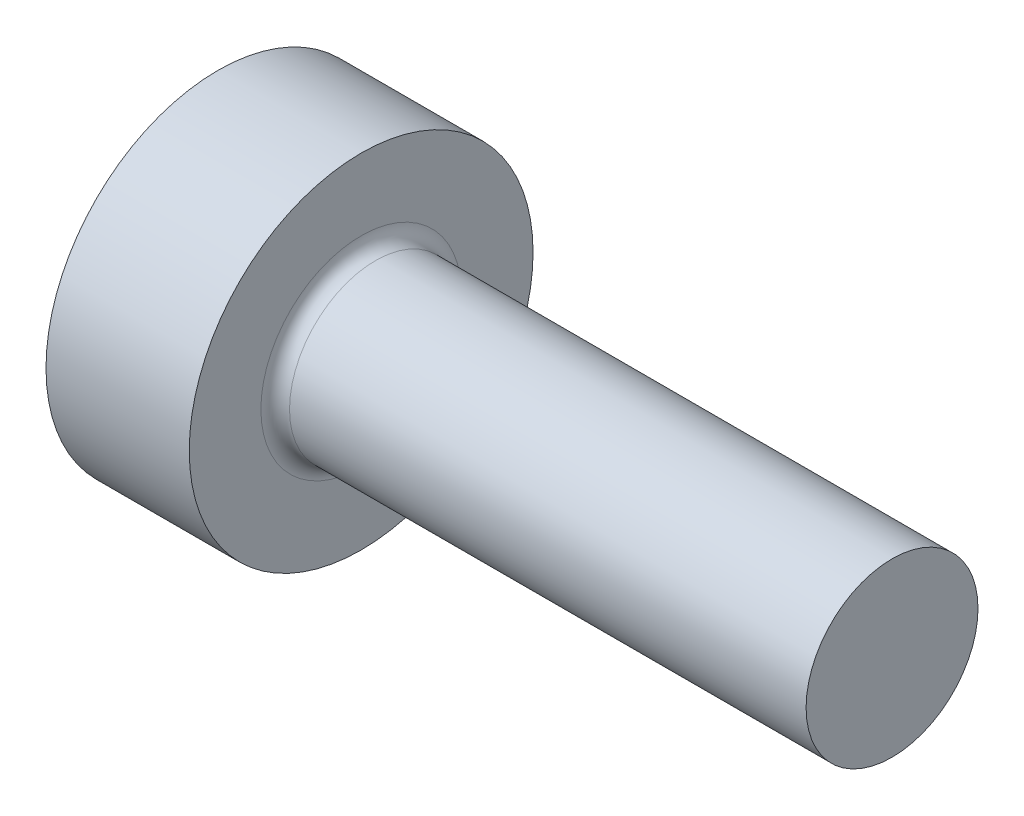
ISO-10303-21;
HEADER;
FILE_DESCRIPTION(('STEP AP214'),'2;1');
FILE_NAME('part.step','',(''),(''),'','','');
FILE_SCHEMA(('AUTOMOTIVE_DESIGN { 1 0 10303 214 1 1 1 1 }'));
ENDSEC;
DATA;
#1=APPLICATION_CONTEXT('core data for automotive mechanical design processes');
#2=APPLICATION_PROTOCOL_DEFINITION('international standard','automotive_design',2000,#1);
#3=PRODUCT_CONTEXT('',#1,'mechanical');
#4=PRODUCT('Part','Part','',(#3));
#5=PRODUCT_RELATED_PRODUCT_CATEGORY('part','',(#4));
#6=PRODUCT_DEFINITION_FORMATION('','',#4);
#7=PRODUCT_DEFINITION_CONTEXT('part definition',#1,'design');
#8=PRODUCT_DEFINITION('design','',#6,#7);
#9=PRODUCT_DEFINITION_SHAPE('','',#8);
#10=(LENGTH_UNIT() NAMED_UNIT(*) SI_UNIT(.MILLI.,.METRE.));
#11=(NAMED_UNIT(*) PLANE_ANGLE_UNIT() SI_UNIT($,.RADIAN.));
#12=(NAMED_UNIT(*) SI_UNIT($,.STERADIAN.) SOLID_ANGLE_UNIT());
#13=UNCERTAINTY_MEASURE_WITH_UNIT(LENGTH_MEASURE(1.E-05),#10,'distance_accuracy_value','');
#14=(GEOMETRIC_REPRESENTATION_CONTEXT(3) GLOBAL_UNCERTAINTY_ASSIGNED_CONTEXT((#13)) GLOBAL_UNIT_ASSIGNED_CONTEXT((#10,
#11,#12)) REPRESENTATION_CONTEXT('',''));
#15=CARTESIAN_POINT('',(0.,0.,0.));
#16=DIRECTION('',(0.,0.,1.));
#17=DIRECTION('',(1.,0.,0.));
#18=AXIS2_PLACEMENT_3D('',#15,#16,#17);
#19=CARTESIAN_POINT('',(0.,0.,0.));
#20=DIRECTION('',(-1.,0.,0.));
#21=DIRECTION('',(0.,0.,1.));
#22=AXIS2_PLACEMENT_3D('',#19,#20,#21);
#23=CYLINDRICAL_SURFACE('',#22,3.);
#24=CARTESIAN_POINT('',(5.5,0.,0.));
#25=DIRECTION('',(-1.,0.,0.));
#26=DIRECTION('',(0.,0.,1.));
#27=AXIS2_PLACEMENT_3D('',#24,#25,#26);
#28=CIRCLE('',#27,3.);
#29=CARTESIAN_POINT('',(5.5,0.,3.));
#30=VERTEX_POINT('',#29);
#31=EDGE_CURVE('E41',#30,#30,#28,.T.);
#32=ORIENTED_EDGE('',*,*,#31,.F.);
#33=EDGE_LOOP('',(#32));
#34=FACE_BOUND('',#33,.T.);
#35=CARTESIAN_POINT('',(23.53,0.,0.));
#36=DIRECTION('',(1.,0.,0.));
#37=DIRECTION('',(0.,0.,-1.));
#38=AXIS2_PLACEMENT_3D('',#35,#36,#37);
#39=CIRCLE('',#38,3.);
#40=CARTESIAN_POINT('',(23.53,0.,-3.));
#41=VERTEX_POINT('',#40);
#42=EDGE_CURVE('E46',#41,#41,#39,.T.);
#43=ORIENTED_EDGE('',*,*,#42,.F.);
#44=EDGE_LOOP('',(#43));
#45=FACE_BOUND('',#44,.T.);
#46=ADVANCED_FACE('F26',(#34,#45),#23,.T.);
#47=CARTESIAN_POINT('',(0.,0.,0.));
#48=DIRECTION('',(-1.,0.,0.));
#49=DIRECTION('',(0.,0.,1.));
#50=AXIS2_PLACEMENT_3D('',#47,#48,#49);
#51=PLANE('',#50);
#52=CARTESIAN_POINT('',(0.,0.,0.));
#53=DIRECTION('',(-1.,0.,0.));
#54=DIRECTION('',(0.,0.,1.));
#55=AXIS2_PLACEMENT_3D('',#52,#53,#54);
#56=CIRCLE('',#55,6.);
#57=CARTESIAN_POINT('',(0.,0.,6.));
#58=VERTEX_POINT('',#57);
#59=EDGE_CURVE('E10',#58,#58,#56,.T.);
#60=ORIENTED_EDGE('',*,*,#59,.T.);
#61=EDGE_LOOP('',(#60));
#62=FACE_BOUND('',#61,.T.);
#63=ADVANCED_FACE('F28',(#62),#51,.T.);
#64=CARTESIAN_POINT('',(0.,0.,0.));
#65=DIRECTION('',(-1.,0.,0.));
#66=DIRECTION('',(0.,0.,1.));
#67=AXIS2_PLACEMENT_3D('',#64,#65,#66);
#68=CYLINDRICAL_SURFACE('',#67,6.);
#69=CARTESIAN_POINT('',(5.,0.,0.));
#70=DIRECTION('',(-1.,0.,0.));
#71=DIRECTION('',(0.,0.,1.));
#72=AXIS2_PLACEMENT_3D('',#69,#70,#71);
#73=CIRCLE('',#72,6.);
#74=CARTESIAN_POINT('',(5.,0.,6.));
#75=VERTEX_POINT('',#74);
#76=EDGE_CURVE('E33',#75,#75,#73,.T.);
#77=ORIENTED_EDGE('',*,*,#76,.T.);
#78=EDGE_LOOP('',(#77));
#79=FACE_BOUND('',#78,.T.);
#80=ORIENTED_EDGE('',*,*,#59,.F.);
#81=EDGE_LOOP('',(#80));
#82=FACE_BOUND('',#81,.T.);
#83=ADVANCED_FACE('F58',(#79,#82),#68,.T.);
#84=CARTESIAN_POINT('',(5.00000000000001,6.,0.));
#85=DIRECTION('',(1.,0.,0.));
#86=DIRECTION('',(0.,0.,-1.));
#87=AXIS2_PLACEMENT_3D('',#84,#85,#86);
#88=PLANE('',#87);
#89=CARTESIAN_POINT('',(5.,0.,0.));
#90=DIRECTION('',(-1.,0.,0.));
#91=DIRECTION('',(0.,0.,1.));
#92=AXIS2_PLACEMENT_3D('',#89,#90,#91);
#93=CIRCLE('',#92,3.5);
#94=CARTESIAN_POINT('',(5.,0.,3.5));
#95=VERTEX_POINT('',#94);
#96=EDGE_CURVE('E37',#95,#95,#93,.T.);
#97=ORIENTED_EDGE('',*,*,#96,.T.);
#98=EDGE_LOOP('',(#97));
#99=FACE_BOUND('',#98,.T.);
#100=ORIENTED_EDGE('',*,*,#76,.F.);
#101=EDGE_LOOP('',(#100));
#102=FACE_BOUND('',#101,.T.);
#103=ADVANCED_FACE('F65',(#99,#102),#88,.T.);
#104=CARTESIAN_POINT('',(5.5,0.,0.));
#105=DIRECTION('',(-1.,0.,0.));
#106=DIRECTION('',(0.,0.,1.));
#107=AXIS2_PLACEMENT_3D('',#104,#105,#106);
#108=TOROIDAL_SURFACE('',#107,3.5,0.5);
#109=ORIENTED_EDGE('',*,*,#31,.T.);
#110=EDGE_LOOP('',(#109));
#111=FACE_BOUND('',#110,.T.);
#112=ORIENTED_EDGE('',*,*,#96,.F.);
#113=EDGE_LOOP('',(#112));
#114=FACE_BOUND('',#113,.T.);
#115=ADVANCED_FACE('F62',(#111,#114),#108,.F.);
#116=CARTESIAN_POINT('',(23.53,0.,0.));
#117=DIRECTION('',(1.,0.,0.));
#118=DIRECTION('',(0.,0.,-1.));
#119=AXIS2_PLACEMENT_3D('',#116,#117,#118);
#120=PLANE('',#119);
#121=ORIENTED_EDGE('',*,*,#42,.T.);
#122=EDGE_LOOP('',(#121));
#123=FACE_BOUND('',#122,.T.);
#124=ADVANCED_FACE('F50',(#123),#120,.T.);
#125=CLOSED_SHELL('',(#46,#63,#83,#103,#115,#124));
#126=MANIFOLD_SOLID_BREP('B2',#125);
#127=ADVANCED_BREP_SHAPE_REPRESENTATION('',(#18,#126),#14);
#128=SHAPE_DEFINITION_REPRESENTATION(#9,#127);
ENDSEC;
END-ISO-10303-21;
